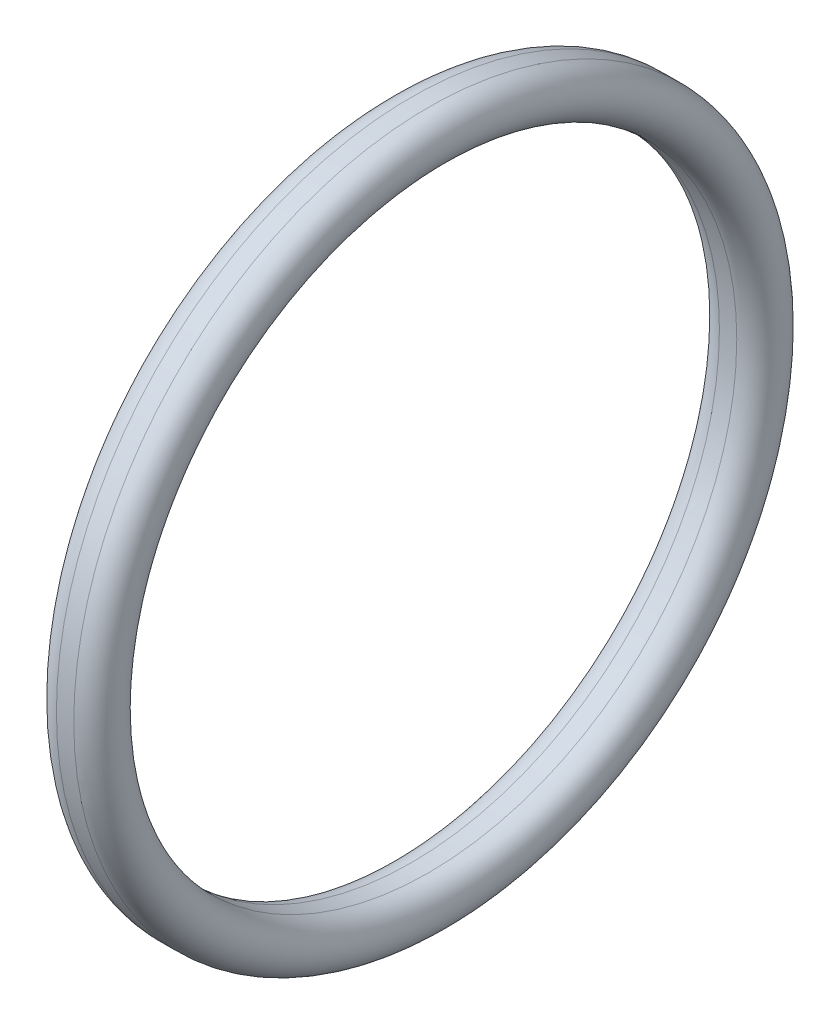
ISO-10303-21;
HEADER;
FILE_DESCRIPTION(('STEP AP214'),'2;1');
FILE_NAME('part.step','',(''),(''),'','','');
FILE_SCHEMA(('AUTOMOTIVE_DESIGN { 1 0 10303 214 1 1 1 1 }'));
ENDSEC;
DATA;
#1=APPLICATION_CONTEXT('core data for automotive mechanical design processes');
#2=APPLICATION_PROTOCOL_DEFINITION('international standard','automotive_design',2000,#1);
#3=PRODUCT_CONTEXT('',#1,'mechanical');
#4=PRODUCT('Part','Part','',(#3));
#5=PRODUCT_RELATED_PRODUCT_CATEGORY('part','',(#4));
#6=PRODUCT_DEFINITION_FORMATION('','',#4);
#7=PRODUCT_DEFINITION_CONTEXT('part definition',#1,'design');
#8=PRODUCT_DEFINITION('design','',#6,#7);
#9=PRODUCT_DEFINITION_SHAPE('','',#8);
#10=(LENGTH_UNIT() NAMED_UNIT(*) SI_UNIT(.MILLI.,.METRE.));
#11=(NAMED_UNIT(*) PLANE_ANGLE_UNIT() SI_UNIT($,.RADIAN.));
#12=(NAMED_UNIT(*) SI_UNIT($,.STERADIAN.) SOLID_ANGLE_UNIT());
#13=UNCERTAINTY_MEASURE_WITH_UNIT(LENGTH_MEASURE(1.E-05),#10,'distance_accuracy_value','');
#14=(GEOMETRIC_REPRESENTATION_CONTEXT(3) GLOBAL_UNCERTAINTY_ASSIGNED_CONTEXT((#13)) GLOBAL_UNIT_ASSIGNED_CONTEXT((#10,
#11,#12)) REPRESENTATION_CONTEXT('',''));
#15=CARTESIAN_POINT('',(0.,0.,0.));
#16=DIRECTION('',(0.,0.,1.));
#17=DIRECTION('',(1.,0.,0.));
#18=AXIS2_PLACEMENT_3D('',#15,#16,#17);
#19=CARTESIAN_POINT('',(-0.3908,0.,0.));
#20=DIRECTION('',(-1.,0.,0.));
#21=DIRECTION('',(0.,0.,1.));
#22=AXIS2_PLACEMENT_3D('',#19,#20,#21);
#23=TOROIDAL_SURFACE('',#22,14.9454,1.0546);
#24=CARTESIAN_POINT('',(-0.3908,0.,0.));
#25=DIRECTION('',(-1.,0.,0.));
#26=DIRECTION('',(0.,0.,1.));
#27=AXIS2_PLACEMENT_3D('',#24,#25,#26);
#28=CIRCLE('',#27,13.8908);
#29=CARTESIAN_POINT('',(-0.3908,0.,13.8908));
#30=VERTEX_POINT('',#29);
#31=EDGE_CURVE('E10',#30,#30,#28,.T.);
#32=ORIENTED_EDGE('',*,*,#31,.F.);
#33=EDGE_LOOP('',(#32));
#34=FACE_BOUND('',#33,.T.);
#35=CARTESIAN_POINT('',(-0.3908,0.,0.));
#36=DIRECTION('',(-1.,0.,0.));
#37=DIRECTION('',(0.,0.,1.));
#38=AXIS2_PLACEMENT_3D('',#35,#36,#37);
#39=CIRCLE('',#38,16.);
#40=CARTESIAN_POINT('',(-0.3908,0.,16.));
#41=VERTEX_POINT('',#40);
#42=EDGE_CURVE('E39',#41,#41,#39,.T.);
#43=ORIENTED_EDGE('',*,*,#42,.T.);
#44=EDGE_LOOP('',(#43));
#45=FACE_BOUND('',#44,.T.);
#46=ADVANCED_FACE('F15',(#34,#45),#23,.T.);
#47=CARTESIAN_POINT('',(0.,0.,0.));
#48=DIRECTION('',(-1.,0.,0.));
#49=DIRECTION('',(0.,0.,1.));
#50=AXIS2_PLACEMENT_3D('',#47,#48,#49);
#51=CYLINDRICAL_SURFACE('',#50,13.8908);
#52=CARTESIAN_POINT('',(0.3908,0.,0.));
#53=DIRECTION('',(-1.,0.,0.));
#54=DIRECTION('',(0.,0.,1.));
#55=AXIS2_PLACEMENT_3D('',#52,#53,#54);
#56=CIRCLE('',#55,13.8908);
#57=CARTESIAN_POINT('',(0.3908,0.,13.8908));
#58=VERTEX_POINT('',#57);
#59=EDGE_CURVE('E22',#58,#58,#56,.T.);
#60=ORIENTED_EDGE('',*,*,#59,.F.);
#61=EDGE_LOOP('',(#60));
#62=FACE_BOUND('',#61,.T.);
#63=ORIENTED_EDGE('',*,*,#31,.T.);
#64=EDGE_LOOP('',(#63));
#65=FACE_BOUND('',#64,.T.);
#66=ADVANCED_FACE('F56',(#62,#65),#51,.F.);
#67=CARTESIAN_POINT('',(0.3908,0.,0.));
#68=DIRECTION('',(-1.,0.,0.));
#69=DIRECTION('',(0.,0.,1.));
#70=AXIS2_PLACEMENT_3D('',#67,#68,#69);
#71=TOROIDAL_SURFACE('',#70,14.9454,1.0546);
#72=CARTESIAN_POINT('',(0.3908,0.,0.));
#73=DIRECTION('',(-1.,0.,0.));
#74=DIRECTION('',(0.,0.,1.));
#75=AXIS2_PLACEMENT_3D('',#72,#73,#74);
#76=CIRCLE('',#75,16.);
#77=CARTESIAN_POINT('',(0.3908,0.,16.));
#78=VERTEX_POINT('',#77);
#79=EDGE_CURVE('E31',#78,#78,#76,.T.);
#80=ORIENTED_EDGE('',*,*,#79,.F.);
#81=EDGE_LOOP('',(#80));
#82=FACE_BOUND('',#81,.T.);
#83=ORIENTED_EDGE('',*,*,#59,.T.);
#84=EDGE_LOOP('',(#83));
#85=FACE_BOUND('',#84,.T.);
#86=ADVANCED_FACE('F49',(#82,#85),#71,.T.);
#87=CARTESIAN_POINT('',(0.,0.,0.));
#88=DIRECTION('',(-1.,0.,0.));
#89=DIRECTION('',(0.,0.,1.));
#90=AXIS2_PLACEMENT_3D('',#87,#88,#89);
#91=CYLINDRICAL_SURFACE('',#90,16.);
#92=ORIENTED_EDGE('',*,*,#79,.T.);
#93=EDGE_LOOP('',(#92));
#94=FACE_BOUND('',#93,.T.);
#95=ORIENTED_EDGE('',*,*,#42,.F.);
#96=EDGE_LOOP('',(#95));
#97=FACE_BOUND('',#96,.T.);
#98=ADVANCED_FACE('F47',(#94,#97),#91,.T.);
#99=CLOSED_SHELL('',(#46,#66,#86,#98));
#100=MANIFOLD_SOLID_BREP('B1',#99);
#101=ADVANCED_BREP_SHAPE_REPRESENTATION('',(#18,#100),#14);
#102=SHAPE_DEFINITION_REPRESENTATION(#9,#101);
ENDSEC;
END-ISO-10303-21;
